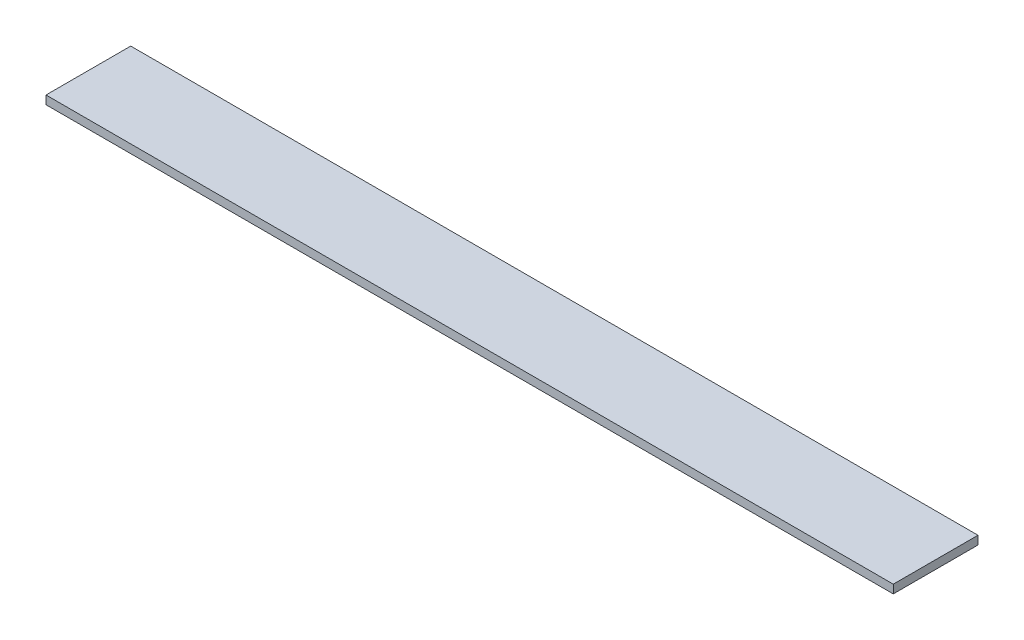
from build123d import *

# Parameters (mm, degrees)
SKETCH1_W           = 1000
SKETCH1_H           = 10
BOSS_EXTRUDE1_DEPTH = 50


with BuildPart() as part:
    # Sketch1 → Boss-Extrude1 (new, symmetric)
    with BuildSketch(Plane.XY):
        Rectangle(SKETCH1_W, SKETCH1_H)
    extrude(amount=BOSS_EXTRUDE1_DEPTH, both=True)


solid = part.part
